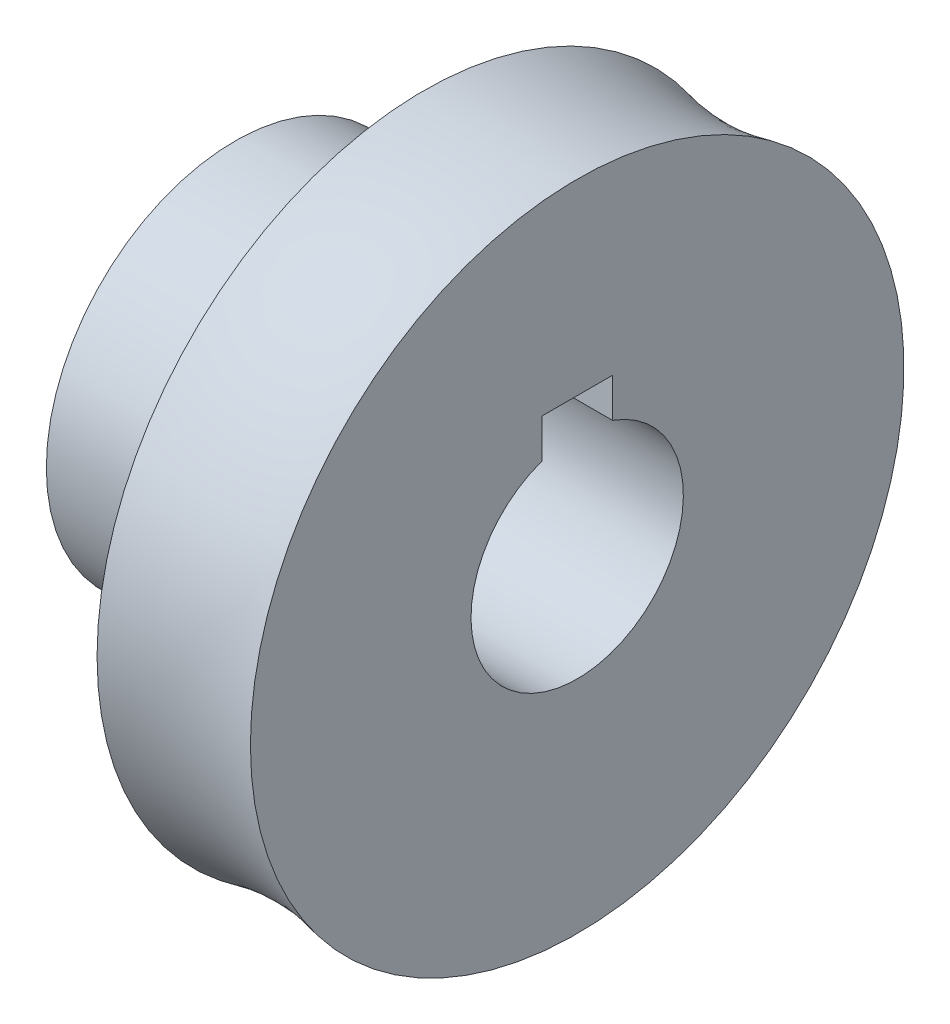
from build123d import *

# Parameters (mm, degrees)
ESQUISSE2_W             = 3
ESQUISSE2_H             = 5.9
ENL_V_MAT_EXTRU_1_DEPTH = 25.369961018


with BuildPart() as part:
    # Esquisse1 → R_volution1 (revolve)
    with BuildSketch(Plane.XY, mode=Mode.PRIVATE) as r_volution1_sk:
        with BuildLine():
            Line((0, 4.5), (14.5, 4.5))
            Line((14.5, 4.5), (14.5, 13.85))
            ThreePointArc((14.5, 13.85), (11.25, 13.467543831), (8, 13.85))
            Line((8, 13.85), (8, 8))
            Line((8, 8), (0, 8))
            Line((0, 8), (0, 4.5))
        make_face()
    revolve(r_volution1_sk.sketch.rotate(Axis((0, 0, 0), (1, 0, 0)), 90), axis=Axis((0, 0, 0), (1, 0, 0)))

    # Esquisse2 → Enl_v. mat.-Extru.1 (cut, through all)
    with BuildSketch(Plane(origin=(14.5, 0, 0), x_dir=(0, 0, -1), z_dir=(1, 0, 0))):
        with Locations((0, 2.95)):
            Rectangle(ESQUISSE2_W, ESQUISSE2_H)
    extrude(amount=-ENL_V_MAT_EXTRU_1_DEPTH, mode=Mode.SUBTRACT)


solid = part.part
